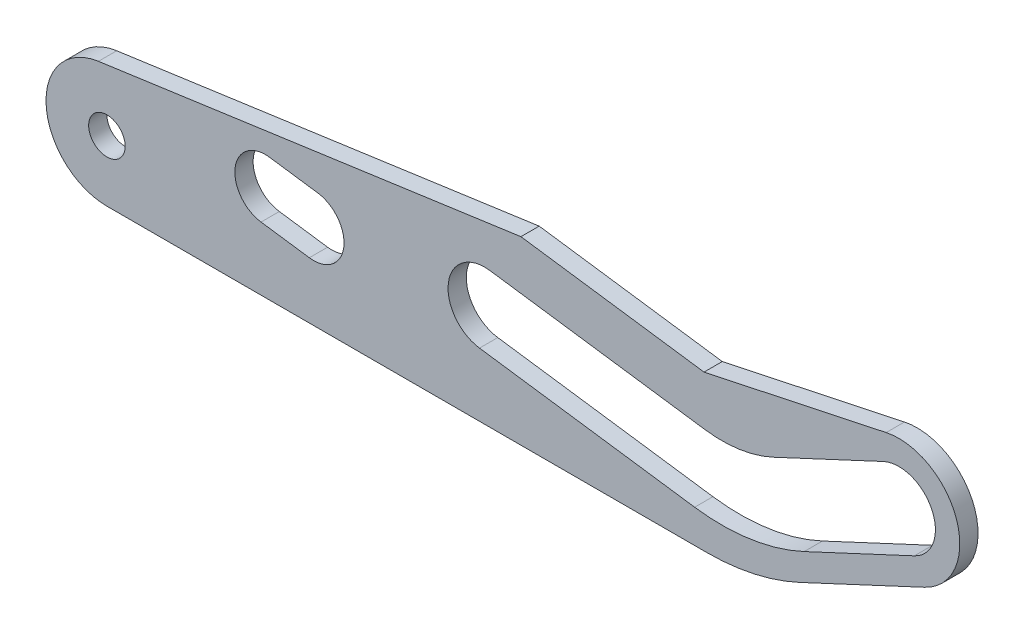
ISO-10303-21;
HEADER;
FILE_DESCRIPTION(('STEP AP214'),'2;1');
FILE_NAME('part.step','',(''),(''),'','','');
FILE_SCHEMA(('AUTOMOTIVE_DESIGN { 1 0 10303 214 1 1 1 1 }'));
ENDSEC;
DATA;
#1=APPLICATION_CONTEXT('core data for automotive mechanical design processes');
#2=APPLICATION_PROTOCOL_DEFINITION('international standard','automotive_design',2000,#1);
#3=PRODUCT_CONTEXT('',#1,'mechanical');
#4=PRODUCT('Part','Part','',(#3));
#5=PRODUCT_RELATED_PRODUCT_CATEGORY('part','',(#4));
#6=PRODUCT_DEFINITION_FORMATION('','',#4);
#7=PRODUCT_DEFINITION_CONTEXT('part definition',#1,'design');
#8=PRODUCT_DEFINITION('design','',#6,#7);
#9=PRODUCT_DEFINITION_SHAPE('','',#8);
#10=(LENGTH_UNIT() NAMED_UNIT(*) SI_UNIT(.MILLI.,.METRE.));
#11=(NAMED_UNIT(*) PLANE_ANGLE_UNIT() SI_UNIT($,.RADIAN.));
#12=(NAMED_UNIT(*) SI_UNIT($,.STERADIAN.) SOLID_ANGLE_UNIT());
#13=UNCERTAINTY_MEASURE_WITH_UNIT(LENGTH_MEASURE(1.E-05),#10,'distance_accuracy_value','');
#14=(GEOMETRIC_REPRESENTATION_CONTEXT(3) GLOBAL_UNCERTAINTY_ASSIGNED_CONTEXT((#13)) GLOBAL_UNIT_ASSIGNED_CONTEXT((#10,
#11,#12)) REPRESENTATION_CONTEXT('',''));
#15=CARTESIAN_POINT('',(0.,0.,0.));
#16=DIRECTION('',(0.,0.,1.));
#17=DIRECTION('',(1.,0.,0.));
#18=AXIS2_PLACEMENT_3D('',#15,#16,#17);
#19=CARTESIAN_POINT('',(0.,0.,0.75));
#20=DIRECTION('',(0.,0.,1.));
#21=DIRECTION('',(1.,0.,0.));
#22=AXIS2_PLACEMENT_3D('',#19,#20,#21);
#23=PLANE('',#22);
#24=CARTESIAN_POINT('',(0.,0.,0.75));
#25=DIRECTION('',(0.,0.,1.));
#26=DIRECTION('',(1.,0.,0.));
#27=AXIS2_PLACEMENT_3D('',#24,#25,#26);
#28=CIRCLE('',#27,1.5);
#29=CARTESIAN_POINT('',(1.5,0.,0.75));
#30=VERTEX_POINT('',#29);
#31=EDGE_CURVE('E175',#30,#30,#28,.T.);
#32=ORIENTED_EDGE('',*,*,#31,.F.);
#33=EDGE_LOOP('',(#32));
#34=FACE_BOUND('',#33,.T.);
#35=CARTESIAN_POINT('',(0.,0.,0.75));
#36=DIRECTION('',(0.,0.,1.));
#37=DIRECTION('',(1.,0.,0.));
#38=AXIS2_PLACEMENT_3D('',#35,#36,#37);
#39=CIRCLE('',#38,5.);
#40=CARTESIAN_POINT('',(-0.695865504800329,4.95134034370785,0.75));
#41=VERTEX_POINT('',#40);
#42=CARTESIAN_POINT('',(0.,-5.,0.75));
#43=VERTEX_POINT('',#42);
#44=EDGE_CURVE('E289',#41,#43,#39,.T.);
#45=ORIENTED_EDGE('',*,*,#44,.T.);
#46=DIRECTION('',(1.,0.,0.));
#47=VECTOR('',#46,1.);
#48=CARTESIAN_POINT('',(0.,-5.,0.75));
#49=LINE('',#48,#47);
#50=CARTESIAN_POINT('',(49.2509278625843,-5.,0.75));
#51=VERTEX_POINT('',#50);
#52=EDGE_CURVE('E292',#43,#51,#49,.T.);
#53=ORIENTED_EDGE('',*,*,#52,.T.);
#54=CARTESIAN_POINT('',(49.2509278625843,13.,0.75));
#55=DIRECTION('',(0.,0.,1.));
#56=DIRECTION('',(1.,0.,0.));
#57=AXIS2_PLACEMENT_3D('',#54,#55,#56);
#58=CIRCLE('',#57,18.);
#59=CARTESIAN_POINT('',(56.8580565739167,-3.31354016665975,0.75));
#60=VERTEX_POINT('',#59);
#61=EDGE_CURVE('E294',#51,#60,#58,.T.);
#62=ORIENTED_EDGE('',*,*,#61,.T.);
#63=DIRECTION('',(0.906307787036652,0.422618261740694,0.));
#64=VECTOR('',#63,1.);
#65=CARTESIAN_POINT('',(67.1130913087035,1.46846106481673,0.75));
#66=LINE('',#65,#64);
#67=CARTESIAN_POINT('',(67.1130913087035,1.46846106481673,0.75));
#68=VERTEX_POINT('',#67);
#69=EDGE_CURVE('E296',#60,#68,#66,.T.);
#70=ORIENTED_EDGE('',*,*,#69,.T.);
#71=CARTESIAN_POINT('',(65.,6.,0.75));
#72=DIRECTION('',(0.,0.,1.));
#73=DIRECTION('',(1.,0.,0.));
#74=AXIS2_PLACEMENT_3D('',#71,#72,#73);
#75=CIRCLE('',#74,5.);
#76=CARTESIAN_POINT('',(63.9604415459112,10.890738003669,0.75));
#77=VERTEX_POINT('',#76);
#78=EDGE_CURVE('E298',#68,#77,#75,.T.);
#79=ORIENTED_EDGE('',*,*,#78,.T.);
#80=DIRECTION('',(-0.978147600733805,-0.207911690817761,0.));
#81=VECTOR('',#80,1.);
#82=CARTESIAN_POINT('',(49.0091398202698,7.71274071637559,0.75));
#83=LINE('',#82,#81);
#84=CARTESIAN_POINT('',(49.0091398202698,7.71274071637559,0.75));
#85=VERTEX_POINT('',#84);
#86=EDGE_CURVE('E300',#77,#85,#83,.T.);
#87=ORIENTED_EDGE('',*,*,#86,.T.);
#88=DIRECTION('',(-0.99026806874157,0.139173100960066,0.));
#89=VECTOR('',#88,1.);
#90=CARTESIAN_POINT('',(33.980829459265,9.82483199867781,0.75));
#91=LINE('',#90,#89);
#92=CARTESIAN_POINT('',(33.980829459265,9.82483199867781,0.75));
#93=VERTEX_POINT('',#92);
#94=EDGE_CURVE('E302',#85,#93,#91,.T.);
#95=ORIENTED_EDGE('',*,*,#94,.T.);
#96=DIRECTION('',(-0.99026806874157,-0.139173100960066,0.));
#97=VECTOR('',#96,1.);
#98=CARTESIAN_POINT('',(-0.695865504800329,4.95134034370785,0.75));
#99=LINE('',#98,#97);
#100=EDGE_CURVE('E304',#93,#41,#99,.T.);
#101=ORIENTED_EDGE('',*,*,#100,.T.);
#102=EDGE_LOOP('',(#45,#53,#62,#70,#79,#87,#95,#101));
#103=FACE_BOUND('',#102,.T.);
#104=DIRECTION('',(0.906307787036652,0.422618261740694,0.));
#105=VECTOR('',#104,1.);
#106=CARTESIAN_POINT('',(66.2678547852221,3.28107663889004,0.75));
#107=LINE('',#106,#105);
#108=CARTESIAN_POINT('',(57.2284860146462,-0.934050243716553,0.75));
#109=VERTEX_POINT('',#108);
#110=CARTESIAN_POINT('',(66.2678547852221,3.28107663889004,0.75));
#111=VERTEX_POINT('',#110);
#112=EDGE_CURVE('E260',#109,#111,#107,.T.);
#113=ORIENTED_EDGE('',*,*,#112,.F.);
#114=CARTESIAN_POINT('',(50.4665938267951,13.5668743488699,0.75));
#115=DIRECTION('',(0.,0.,1.));
#116=DIRECTION('',(1.,0.,0.));
#117=AXIS2_PLACEMENT_3D('',#114,#115,#116);
#118=CIRCLE('',#117,16.);
#119=CARTESIAN_POINT('',(48.2398242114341,-2.27741475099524,0.75));
#120=VERTEX_POINT('',#119);
#121=EDGE_CURVE('E258',#120,#109,#118,.T.);
#122=ORIENTED_EDGE('',*,*,#121,.F.);
#123=DIRECTION('',(0.99026806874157,-0.139173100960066,0.));
#124=VECTOR('',#123,1.);
#125=CARTESIAN_POINT('',(30.5824806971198,0.20416304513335,0.75));
#126=LINE('',#125,#124);
#127=CARTESIAN_POINT('',(30.5824806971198,0.20416304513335,0.75));
#128=VERTEX_POINT('',#127);
#129=EDGE_CURVE('E272',#128,#120,#126,.T.);
#130=ORIENTED_EDGE('',*,*,#129,.F.);
#131=CARTESIAN_POINT('',(31.,3.17496725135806,0.75));
#132=DIRECTION('',(0.,0.,1.));
#133=DIRECTION('',(1.,0.,0.));
#134=AXIS2_PLACEMENT_3D('',#131,#132,#133);
#135=CIRCLE('',#134,3.);
#136=CARTESIAN_POINT('',(31.4175193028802,6.14577145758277,0.75));
#137=VERTEX_POINT('',#136);
#138=EDGE_CURVE('E270',#137,#128,#135,.T.);
#139=ORIENTED_EDGE('',*,*,#138,.F.);
#140=DIRECTION('',(-0.99026806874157,0.139173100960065,0.));
#141=VECTOR('',#140,1.);
#142=CARTESIAN_POINT('',(31.4175193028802,6.14577145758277,0.75));
#143=LINE('',#142,#141);
#144=CARTESIAN_POINT('',(49.0748628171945,3.66419366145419,0.75));
#145=VERTEX_POINT('',#144);
#146=EDGE_CURVE('E268',#145,#137,#143,.T.);
#147=ORIENTED_EDGE('',*,*,#146,.F.);
#148=CARTESIAN_POINT('',(50.4665938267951,13.5668743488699,0.75));
#149=DIRECTION('',(0.,0.,-1.));
#150=DIRECTION('',(1.,0.,0.));
#151=AXIS2_PLACEMENT_3D('',#148,#149,#150);
#152=CIRCLE('',#151,10.);
#153=CARTESIAN_POINT('',(54.692776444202,4.50379647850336,0.75));
#154=VERTEX_POINT('',#153);
#155=EDGE_CURVE('E266',#154,#145,#152,.T.);
#156=ORIENTED_EDGE('',*,*,#155,.F.);
#157=DIRECTION('',(-0.906307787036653,-0.422618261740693,0.));
#158=VECTOR('',#157,1.);
#159=CARTESIAN_POINT('',(63.7321452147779,8.71892336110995,0.75));
#160=LINE('',#159,#158);
#161=CARTESIAN_POINT('',(63.7321452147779,8.71892336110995,0.75));
#162=VERTEX_POINT('',#161);
#163=EDGE_CURVE('E264',#162,#154,#160,.T.);
#164=ORIENTED_EDGE('',*,*,#163,.F.);
#165=CARTESIAN_POINT('',(65.,6.,0.75));
#166=DIRECTION('',(0.,0.,1.));
#167=DIRECTION('',(1.,0.,0.));
#168=AXIS2_PLACEMENT_3D('',#165,#166,#167);
#169=CIRCLE('',#168,2.99999999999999);
#170=EDGE_CURVE('E262',#111,#162,#169,.T.);
#171=ORIENTED_EDGE('',*,*,#170,.F.);
#172=EDGE_LOOP('',(#113,#122,#130,#139,#147,#156,#164,#171));
#173=FACE_BOUND('',#172,.T.);
#174=DIRECTION('',(-0.99026806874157,0.139173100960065,0.));
#175=VECTOR('',#174,1.);
#176=CARTESIAN_POINT('',(17.3090050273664,4.59419732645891,0.75));
#177=LINE('',#176,#175);
#178=CARTESIAN_POINT('',(17.3090050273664,4.59419732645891,0.75));
#179=VERTEX_POINT('',#178);
#180=CARTESIAN_POINT('',(13.3479327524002,5.15088973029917,0.75));
#181=VERTEX_POINT('',#180);
#182=EDGE_CURVE('E246',#179,#181,#177,.T.);
#183=ORIENTED_EDGE('',*,*,#182,.F.);
#184=CARTESIAN_POINT('',(16.9610722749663,2.11852715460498,0.75));
#185=DIRECTION('',(0.,0.,1.));
#186=DIRECTION('',(1.,0.,0.));
#187=AXIS2_PLACEMENT_3D('',#184,#185,#186);
#188=CIRCLE('',#187,2.5);
#189=CARTESIAN_POINT('',(16.6131395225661,-0.357143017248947,0.75));
#190=VERTEX_POINT('',#189);
#191=EDGE_CURVE('E172',#190,#179,#188,.T.);
#192=ORIENTED_EDGE('',*,*,#191,.F.);
#193=DIRECTION('',(0.99026806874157,-0.139173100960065,0.));
#194=VECTOR('',#193,1.);
#195=CARTESIAN_POINT('',(16.6131395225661,-0.357143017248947,0.75));
#196=LINE('',#195,#194);
#197=CARTESIAN_POINT('',(12.6520672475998,0.199549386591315,0.75));
#198=VERTEX_POINT('',#197);
#199=EDGE_CURVE('E250',#198,#190,#196,.T.);
#200=ORIENTED_EDGE('',*,*,#199,.F.);
#201=CARTESIAN_POINT('',(13.,2.67521955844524,0.75));
#202=DIRECTION('',(0.,0.,1.));
#203=DIRECTION('',(1.,0.,0.));
#204=AXIS2_PLACEMENT_3D('',#201,#202,#203);
#205=CIRCLE('',#204,2.5);
#206=EDGE_CURVE('E248',#181,#198,#205,.T.);
#207=ORIENTED_EDGE('',*,*,#206,.F.);
#208=EDGE_LOOP('',(#183,#192,#200,#207));
#209=FACE_BOUND('',#208,.T.);
#210=ADVANCED_FACE('F28',(#34,#103,#173,#209),#23,.T.);
#211=CARTESIAN_POINT('',(0.,0.,0.75));
#212=DIRECTION('',(0.,0.,-1.));
#213=DIRECTION('',(-1.,0.,0.));
#214=AXIS2_PLACEMENT_3D('',#211,#212,#213);
#215=CYLINDRICAL_SURFACE('',#214,5.);
#216=DIRECTION('',(0.,0.,-1.));
#217=VECTOR('',#216,1.);
#218=CARTESIAN_POINT('',(-0.695865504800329,4.95134034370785,0.75));
#219=LINE('',#218,#217);
#220=CARTESIAN_POINT('',(-0.695865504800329,4.95134034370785,-0.75));
#221=VERTEX_POINT('',#220);
#222=EDGE_CURVE('E306',#41,#221,#219,.T.);
#223=ORIENTED_EDGE('',*,*,#222,.T.);
#224=CARTESIAN_POINT('',(0.,0.,-0.75));
#225=DIRECTION('',(0.,0.,1.));
#226=DIRECTION('',(1.,0.,0.));
#227=AXIS2_PLACEMENT_3D('',#224,#225,#226);
#228=CIRCLE('',#227,5.);
#229=CARTESIAN_POINT('',(0.,-5.,-0.75));
#230=VERTEX_POINT('',#229);
#231=EDGE_CURVE('E221',#221,#230,#228,.T.);
#232=ORIENTED_EDGE('',*,*,#231,.T.);
#233=DIRECTION('',(0.,0.,-1.));
#234=VECTOR('',#233,1.);
#235=CARTESIAN_POINT('',(0.,-5.,0.75));
#236=LINE('',#235,#234);
#237=EDGE_CURVE('E11',#43,#230,#236,.T.);
#238=ORIENTED_EDGE('',*,*,#237,.F.);
#239=ORIENTED_EDGE('',*,*,#44,.F.);
#240=EDGE_LOOP('',(#223,#232,#238,#239));
#241=FACE_BOUND('',#240,.T.);
#242=ADVANCED_FACE('F30',(#241),#215,.T.);
#243=CARTESIAN_POINT('',(0.,-5.,0.75));
#244=DIRECTION('',(0.,1.,0.));
#245=DIRECTION('',(-1.,0.,0.));
#246=AXIS2_PLACEMENT_3D('',#243,#244,#245);
#247=PLANE('',#246);
#248=ORIENTED_EDGE('',*,*,#237,.T.);
#249=DIRECTION('',(1.,0.,0.));
#250=VECTOR('',#249,1.);
#251=CARTESIAN_POINT('',(0.,-5.,-0.75));
#252=LINE('',#251,#250);
#253=CARTESIAN_POINT('',(49.2509278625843,-5.,-0.75));
#254=VERTEX_POINT('',#253);
#255=EDGE_CURVE('E224',#230,#254,#252,.T.);
#256=ORIENTED_EDGE('',*,*,#255,.T.);
#257=DIRECTION('',(0.,0.,-1.));
#258=VECTOR('',#257,1.);
#259=CARTESIAN_POINT('',(49.2509278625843,-5.,0.75));
#260=LINE('',#259,#258);
#261=EDGE_CURVE('E36',#51,#254,#260,.T.);
#262=ORIENTED_EDGE('',*,*,#261,.F.);
#263=ORIENTED_EDGE('',*,*,#52,.F.);
#264=EDGE_LOOP('',(#248,#256,#262,#263));
#265=FACE_BOUND('',#264,.T.);
#266=ADVANCED_FACE('F329',(#265),#247,.F.);
#267=CARTESIAN_POINT('',(49.2509278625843,13.,0.75));
#268=DIRECTION('',(0.,0.,-1.));
#269=DIRECTION('',(-1.,0.,0.));
#270=AXIS2_PLACEMENT_3D('',#267,#268,#269);
#271=CYLINDRICAL_SURFACE('',#270,18.);
#272=ORIENTED_EDGE('',*,*,#261,.T.);
#273=CARTESIAN_POINT('',(49.2509278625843,13.,-0.75));
#274=DIRECTION('',(0.,0.,1.));
#275=DIRECTION('',(1.,0.,0.));
#276=AXIS2_PLACEMENT_3D('',#273,#274,#275);
#277=CIRCLE('',#276,18.);
#278=CARTESIAN_POINT('',(56.8580565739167,-3.31354016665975,-0.75));
#279=VERTEX_POINT('',#278);
#280=EDGE_CURVE('E227',#254,#279,#277,.T.);
#281=ORIENTED_EDGE('',*,*,#280,.T.);
#282=DIRECTION('',(0.,0.,-1.));
#283=VECTOR('',#282,1.);
#284=CARTESIAN_POINT('',(56.8580565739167,-3.31354016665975,0.75));
#285=LINE('',#284,#283);
#286=EDGE_CURVE('E316',#60,#279,#285,.T.);
#287=ORIENTED_EDGE('',*,*,#286,.F.);
#288=ORIENTED_EDGE('',*,*,#61,.F.);
#289=EDGE_LOOP('',(#272,#281,#287,#288));
#290=FACE_BOUND('',#289,.T.);
#291=ADVANCED_FACE('F321',(#290),#271,.T.);
#292=CARTESIAN_POINT('',(67.1130913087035,1.46846106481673,0.75));
#293=DIRECTION('',(-0.422618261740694,0.906307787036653,0.));
#294=DIRECTION('',(-0.906307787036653,-0.422618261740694,0.));
#295=AXIS2_PLACEMENT_3D('',#292,#293,#294);
#296=PLANE('',#295);
#297=ORIENTED_EDGE('',*,*,#286,.T.);
#298=DIRECTION('',(0.906307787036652,0.422618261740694,0.));
#299=VECTOR('',#298,1.);
#300=CARTESIAN_POINT('',(67.1130913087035,1.46846106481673,-0.75));
#301=LINE('',#300,#299);
#302=CARTESIAN_POINT('',(67.1130913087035,1.46846106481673,-0.75));
#303=VERTEX_POINT('',#302);
#304=EDGE_CURVE('E230',#279,#303,#301,.T.);
#305=ORIENTED_EDGE('',*,*,#304,.T.);
#306=DIRECTION('',(0.,0.,-1.));
#307=VECTOR('',#306,1.);
#308=CARTESIAN_POINT('',(67.1130913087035,1.46846106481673,0.75));
#309=LINE('',#308,#307);
#310=EDGE_CURVE('E314',#68,#303,#309,.T.);
#311=ORIENTED_EDGE('',*,*,#310,.F.);
#312=ORIENTED_EDGE('',*,*,#69,.F.);
#313=EDGE_LOOP('',(#297,#305,#311,#312));
#314=FACE_BOUND('',#313,.T.);
#315=ADVANCED_FACE('F354',(#314),#296,.F.);
#316=CARTESIAN_POINT('',(65.,6.,0.75));
#317=DIRECTION('',(0.,0.,-1.));
#318=DIRECTION('',(-1.,0.,0.));
#319=AXIS2_PLACEMENT_3D('',#316,#317,#318);
#320=CYLINDRICAL_SURFACE('',#319,5.);
#321=ORIENTED_EDGE('',*,*,#310,.T.);
#322=CARTESIAN_POINT('',(65.,6.,-0.75));
#323=DIRECTION('',(0.,0.,1.));
#324=DIRECTION('',(1.,0.,0.));
#325=AXIS2_PLACEMENT_3D('',#322,#323,#324);
#326=CIRCLE('',#325,5.);
#327=CARTESIAN_POINT('',(63.9604415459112,10.890738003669,-0.75));
#328=VERTEX_POINT('',#327);
#329=EDGE_CURVE('E233',#303,#328,#326,.T.);
#330=ORIENTED_EDGE('',*,*,#329,.T.);
#331=DIRECTION('',(0.,0.,-1.));
#332=VECTOR('',#331,1.);
#333=CARTESIAN_POINT('',(63.9604415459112,10.890738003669,0.75));
#334=LINE('',#333,#332);
#335=EDGE_CURVE('E312',#77,#328,#334,.T.);
#336=ORIENTED_EDGE('',*,*,#335,.F.);
#337=ORIENTED_EDGE('',*,*,#78,.F.);
#338=EDGE_LOOP('',(#321,#330,#336,#337));
#339=FACE_BOUND('',#338,.T.);
#340=ADVANCED_FACE('F351',(#339),#320,.T.);
#341=CARTESIAN_POINT('',(49.0091398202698,7.71274071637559,0.75));
#342=DIRECTION('',(0.207911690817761,-0.978147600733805,0.));
#343=DIRECTION('',(0.978147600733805,0.207911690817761,0.));
#344=AXIS2_PLACEMENT_3D('',#341,#342,#343);
#345=PLANE('',#344);
#346=ORIENTED_EDGE('',*,*,#335,.T.);
#347=DIRECTION('',(-0.978147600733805,-0.207911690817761,0.));
#348=VECTOR('',#347,1.);
#349=CARTESIAN_POINT('',(49.0091398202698,7.71274071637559,-0.75));
#350=LINE('',#349,#348);
#351=CARTESIAN_POINT('',(49.0091398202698,7.71274071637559,-0.75));
#352=VERTEX_POINT('',#351);
#353=EDGE_CURVE('E236',#328,#352,#350,.T.);
#354=ORIENTED_EDGE('',*,*,#353,.T.);
#355=DIRECTION('',(0.,0.,-1.));
#356=VECTOR('',#355,1.);
#357=CARTESIAN_POINT('',(49.0091398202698,7.71274071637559,0.75));
#358=LINE('',#357,#356);
#359=EDGE_CURVE('E310',#85,#352,#358,.T.);
#360=ORIENTED_EDGE('',*,*,#359,.F.);
#361=ORIENTED_EDGE('',*,*,#86,.F.);
#362=EDGE_LOOP('',(#346,#354,#360,#361));
#363=FACE_BOUND('',#362,.T.);
#364=ADVANCED_FACE('F346',(#363),#345,.F.);
#365=CARTESIAN_POINT('',(33.980829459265,9.82483199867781,0.75));
#366=DIRECTION('',(-0.139173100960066,-0.99026806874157,0.));
#367=DIRECTION('',(0.99026806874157,-0.139173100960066,0.));
#368=AXIS2_PLACEMENT_3D('',#365,#366,#367);
#369=PLANE('',#368);
#370=ORIENTED_EDGE('',*,*,#359,.T.);
#371=DIRECTION('',(-0.99026806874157,0.139173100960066,0.));
#372=VECTOR('',#371,1.);
#373=CARTESIAN_POINT('',(33.980829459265,9.82483199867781,-0.75));
#374=LINE('',#373,#372);
#375=CARTESIAN_POINT('',(33.980829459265,9.82483199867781,-0.75));
#376=VERTEX_POINT('',#375);
#377=EDGE_CURVE('E239',#352,#376,#374,.T.);
#378=ORIENTED_EDGE('',*,*,#377,.T.);
#379=DIRECTION('',(0.,0.,-1.));
#380=VECTOR('',#379,1.);
#381=CARTESIAN_POINT('',(33.980829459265,9.82483199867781,0.75));
#382=LINE('',#381,#380);
#383=EDGE_CURVE('E308',#93,#376,#382,.T.);
#384=ORIENTED_EDGE('',*,*,#383,.F.);
#385=ORIENTED_EDGE('',*,*,#94,.F.);
#386=EDGE_LOOP('',(#370,#378,#384,#385));
#387=FACE_BOUND('',#386,.T.);
#388=ADVANCED_FACE('F342',(#387),#369,.F.);
#389=CARTESIAN_POINT('',(-0.695865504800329,4.95134034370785,0.75));
#390=DIRECTION('',(0.139173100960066,-0.99026806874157,0.));
#391=DIRECTION('',(0.99026806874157,0.139173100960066,0.));
#392=AXIS2_PLACEMENT_3D('',#389,#390,#391);
#393=PLANE('',#392);
#394=ORIENTED_EDGE('',*,*,#383,.T.);
#395=DIRECTION('',(-0.99026806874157,-0.139173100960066,0.));
#396=VECTOR('',#395,1.);
#397=CARTESIAN_POINT('',(-0.695865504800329,4.95134034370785,-0.75));
#398=LINE('',#397,#396);
#399=EDGE_CURVE('E242',#376,#221,#398,.T.);
#400=ORIENTED_EDGE('',*,*,#399,.T.);
#401=ORIENTED_EDGE('',*,*,#222,.F.);
#402=ORIENTED_EDGE('',*,*,#100,.F.);
#403=EDGE_LOOP('',(#394,#400,#401,#402));
#404=FACE_BOUND('',#403,.T.);
#405=ADVANCED_FACE('F337',(#404),#393,.F.);
#406=CARTESIAN_POINT('',(50.4665938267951,13.5668743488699,0.75));
#407=DIRECTION('',(0.,0.,-1.));
#408=DIRECTION('',(-1.,0.,0.));
#409=AXIS2_PLACEMENT_3D('',#406,#407,#408);
#410=CYLINDRICAL_SURFACE('',#409,16.);
#411=DIRECTION('',(0.,0.,-1.));
#412=VECTOR('',#411,1.);
#413=CARTESIAN_POINT('',(57.2284860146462,-0.934050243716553,0.75));
#414=LINE('',#413,#412);
#415=CARTESIAN_POINT('',(57.2284860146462,-0.934050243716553,-0.75));
#416=VERTEX_POINT('',#415);
#417=EDGE_CURVE('E287',#109,#416,#414,.T.);
#418=ORIENTED_EDGE('',*,*,#417,.T.);
#419=CARTESIAN_POINT('',(50.4665938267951,13.5668743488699,-0.75));
#420=DIRECTION('',(0.,0.,1.));
#421=DIRECTION('',(1.,0.,0.));
#422=AXIS2_PLACEMENT_3D('',#419,#420,#421);
#423=CIRCLE('',#422,16.);
#424=CARTESIAN_POINT('',(48.2398242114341,-2.27741475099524,-0.75));
#425=VERTEX_POINT('',#424);
#426=EDGE_CURVE('E197',#425,#416,#423,.T.);
#427=ORIENTED_EDGE('',*,*,#426,.F.);
#428=DIRECTION('',(0.,0.,-1.));
#429=VECTOR('',#428,1.);
#430=CARTESIAN_POINT('',(48.2398242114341,-2.27741475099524,0.75));
#431=LINE('',#430,#429);
#432=EDGE_CURVE('E274',#120,#425,#431,.T.);
#433=ORIENTED_EDGE('',*,*,#432,.F.);
#434=ORIENTED_EDGE('',*,*,#121,.T.);
#435=EDGE_LOOP('',(#418,#427,#433,#434));
#436=FACE_BOUND('',#435,.T.);
#437=ADVANCED_FACE('F413',(#436),#410,.F.);
#438=CARTESIAN_POINT('',(66.2678547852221,3.28107663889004,0.75));
#439=DIRECTION('',(-0.422618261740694,0.906307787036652,0.));
#440=DIRECTION('',(-0.906307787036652,-0.422618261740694,0.));
#441=AXIS2_PLACEMENT_3D('',#438,#439,#440);
#442=PLANE('',#441);
#443=DIRECTION('',(0.,0.,-1.));
#444=VECTOR('',#443,1.);
#445=CARTESIAN_POINT('',(66.2678547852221,3.28107663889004,0.75));
#446=LINE('',#445,#444);
#447=CARTESIAN_POINT('',(66.2678547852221,3.28107663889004,-0.75));
#448=VERTEX_POINT('',#447);
#449=EDGE_CURVE('E285',#111,#448,#446,.T.);
#450=ORIENTED_EDGE('',*,*,#449,.T.);
#451=DIRECTION('',(0.906307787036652,0.422618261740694,0.));
#452=VECTOR('',#451,1.);
#453=CARTESIAN_POINT('',(66.2678547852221,3.28107663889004,-0.75));
#454=LINE('',#453,#452);
#455=EDGE_CURVE('E200',#416,#448,#454,.T.);
#456=ORIENTED_EDGE('',*,*,#455,.F.);
#457=ORIENTED_EDGE('',*,*,#417,.F.);
#458=ORIENTED_EDGE('',*,*,#112,.T.);
#459=EDGE_LOOP('',(#450,#456,#457,#458));
#460=FACE_BOUND('',#459,.T.);
#461=ADVANCED_FACE('F409',(#460),#442,.T.);
#462=CARTESIAN_POINT('',(65.,6.,0.75));
#463=DIRECTION('',(0.,0.,-1.));
#464=DIRECTION('',(-1.,0.,0.));
#465=AXIS2_PLACEMENT_3D('',#462,#463,#464);
#466=CYLINDRICAL_SURFACE('',#465,2.99999999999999);
#467=DIRECTION('',(0.,0.,-1.));
#468=VECTOR('',#467,1.);
#469=CARTESIAN_POINT('',(63.7321452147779,8.71892336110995,0.75));
#470=LINE('',#469,#468);
#471=CARTESIAN_POINT('',(63.7321452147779,8.71892336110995,-0.75));
#472=VERTEX_POINT('',#471);
#473=EDGE_CURVE('E283',#162,#472,#470,.T.);
#474=ORIENTED_EDGE('',*,*,#473,.T.);
#475=CARTESIAN_POINT('',(65.,6.,-0.75));
#476=DIRECTION('',(0.,0.,1.));
#477=DIRECTION('',(1.,0.,0.));
#478=AXIS2_PLACEMENT_3D('',#475,#476,#477);
#479=CIRCLE('',#478,2.99999999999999);
#480=EDGE_CURVE('E203',#448,#472,#479,.T.);
#481=ORIENTED_EDGE('',*,*,#480,.F.);
#482=ORIENTED_EDGE('',*,*,#449,.F.);
#483=ORIENTED_EDGE('',*,*,#170,.T.);
#484=EDGE_LOOP('',(#474,#481,#482,#483));
#485=FACE_BOUND('',#484,.T.);
#486=ADVANCED_FACE('F405',(#485),#466,.F.);
#487=CARTESIAN_POINT('',(63.7321452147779,8.71892336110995,0.75));
#488=DIRECTION('',(0.422618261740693,-0.906307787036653,0.));
#489=DIRECTION('',(0.906307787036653,0.422618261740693,0.));
#490=AXIS2_PLACEMENT_3D('',#487,#488,#489);
#491=PLANE('',#490);
#492=DIRECTION('',(0.,0.,-1.));
#493=VECTOR('',#492,1.);
#494=CARTESIAN_POINT('',(54.692776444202,4.50379647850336,0.75));
#495=LINE('',#494,#493);
#496=CARTESIAN_POINT('',(54.692776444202,4.50379647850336,-0.75));
#497=VERTEX_POINT('',#496);
#498=EDGE_CURVE('E281',#154,#497,#495,.T.);
#499=ORIENTED_EDGE('',*,*,#498,.T.);
#500=DIRECTION('',(-0.906307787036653,-0.422618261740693,0.));
#501=VECTOR('',#500,1.);
#502=CARTESIAN_POINT('',(63.7321452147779,8.71892336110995,-0.75));
#503=LINE('',#502,#501);
#504=EDGE_CURVE('E206',#472,#497,#503,.T.);
#505=ORIENTED_EDGE('',*,*,#504,.F.);
#506=ORIENTED_EDGE('',*,*,#473,.F.);
#507=ORIENTED_EDGE('',*,*,#163,.T.);
#508=EDGE_LOOP('',(#499,#505,#506,#507));
#509=FACE_BOUND('',#508,.T.);
#510=ADVANCED_FACE('F401',(#509),#491,.T.);
#511=CARTESIAN_POINT('',(50.4665938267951,13.5668743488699,0.75));
#512=DIRECTION('',(0.,0.,-1.));
#513=DIRECTION('',(-1.,0.,0.));
#514=AXIS2_PLACEMENT_3D('',#511,#512,#513);
#515=CYLINDRICAL_SURFACE('',#514,10.);
#516=DIRECTION('',(0.,0.,-1.));
#517=VECTOR('',#516,1.);
#518=CARTESIAN_POINT('',(49.0748628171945,3.66419366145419,0.75));
#519=LINE('',#518,#517);
#520=CARTESIAN_POINT('',(49.0748628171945,3.66419366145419,-0.75));
#521=VERTEX_POINT('',#520);
#522=EDGE_CURVE('E279',#145,#521,#519,.T.);
#523=ORIENTED_EDGE('',*,*,#522,.T.);
#524=CARTESIAN_POINT('',(50.4665938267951,13.5668743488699,-0.75));
#525=DIRECTION('',(0.,0.,-1.));
#526=DIRECTION('',(1.,0.,0.));
#527=AXIS2_PLACEMENT_3D('',#524,#525,#526);
#528=CIRCLE('',#527,10.);
#529=EDGE_CURVE('E209',#497,#521,#528,.T.);
#530=ORIENTED_EDGE('',*,*,#529,.F.);
#531=ORIENTED_EDGE('',*,*,#498,.F.);
#532=ORIENTED_EDGE('',*,*,#155,.T.);
#533=EDGE_LOOP('',(#523,#530,#531,#532));
#534=FACE_BOUND('',#533,.T.);
#535=ADVANCED_FACE('F397',(#534),#515,.T.);
#536=CARTESIAN_POINT('',(31.4175193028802,6.14577145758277,0.75));
#537=DIRECTION('',(-0.139173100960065,-0.99026806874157,0.));
#538=DIRECTION('',(0.99026806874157,-0.139173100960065,0.));
#539=AXIS2_PLACEMENT_3D('',#536,#537,#538);
#540=PLANE('',#539);
#541=DIRECTION('',(0.,0.,-1.));
#542=VECTOR('',#541,1.);
#543=CARTESIAN_POINT('',(31.4175193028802,6.14577145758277,0.75));
#544=LINE('',#543,#542);
#545=CARTESIAN_POINT('',(31.4175193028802,6.14577145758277,-0.75));
#546=VERTEX_POINT('',#545);
#547=EDGE_CURVE('E277',#137,#546,#544,.T.);
#548=ORIENTED_EDGE('',*,*,#547,.T.);
#549=DIRECTION('',(-0.99026806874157,0.139173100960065,0.));
#550=VECTOR('',#549,1.);
#551=CARTESIAN_POINT('',(31.4175193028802,6.14577145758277,-0.75));
#552=LINE('',#551,#550);
#553=EDGE_CURVE('E212',#521,#546,#552,.T.);
#554=ORIENTED_EDGE('',*,*,#553,.F.);
#555=ORIENTED_EDGE('',*,*,#522,.F.);
#556=ORIENTED_EDGE('',*,*,#146,.T.);
#557=EDGE_LOOP('',(#548,#554,#555,#556));
#558=FACE_BOUND('',#557,.T.);
#559=ADVANCED_FACE('F393',(#558),#540,.T.);
#560=CARTESIAN_POINT('',(31.,3.17496725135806,0.75));
#561=DIRECTION('',(0.,0.,-1.));
#562=DIRECTION('',(-1.,0.,0.));
#563=AXIS2_PLACEMENT_3D('',#560,#561,#562);
#564=CYLINDRICAL_SURFACE('',#563,3.);
#565=DIRECTION('',(0.,0.,-1.));
#566=VECTOR('',#565,1.);
#567=CARTESIAN_POINT('',(30.5824806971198,0.20416304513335,0.75));
#568=LINE('',#567,#566);
#569=CARTESIAN_POINT('',(30.5824806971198,0.20416304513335,-0.75));
#570=VERTEX_POINT('',#569);
#571=EDGE_CURVE('E51',#128,#570,#568,.T.);
#572=ORIENTED_EDGE('',*,*,#571,.T.);
#573=CARTESIAN_POINT('',(31.,3.17496725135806,-0.75));
#574=DIRECTION('',(0.,0.,1.));
#575=DIRECTION('',(1.,0.,0.));
#576=AXIS2_PLACEMENT_3D('',#573,#574,#575);
#577=CIRCLE('',#576,3.);
#578=EDGE_CURVE('E215',#546,#570,#577,.T.);
#579=ORIENTED_EDGE('',*,*,#578,.F.);
#580=ORIENTED_EDGE('',*,*,#547,.F.);
#581=ORIENTED_EDGE('',*,*,#138,.T.);
#582=EDGE_LOOP('',(#572,#579,#580,#581));
#583=FACE_BOUND('',#582,.T.);
#584=ADVANCED_FACE('F390',(#583),#564,.F.);
#585=CARTESIAN_POINT('',(30.5824806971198,0.20416304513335,0.75));
#586=DIRECTION('',(0.139173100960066,0.99026806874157,0.));
#587=DIRECTION('',(-0.99026806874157,0.139173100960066,0.));
#588=AXIS2_PLACEMENT_3D('',#585,#586,#587);
#589=PLANE('',#588);
#590=ORIENTED_EDGE('',*,*,#432,.T.);
#591=DIRECTION('',(0.99026806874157,-0.139173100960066,0.));
#592=VECTOR('',#591,1.);
#593=CARTESIAN_POINT('',(30.5824806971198,0.20416304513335,-0.75));
#594=LINE('',#593,#592);
#595=EDGE_CURVE('E218',#570,#425,#594,.T.);
#596=ORIENTED_EDGE('',*,*,#595,.F.);
#597=ORIENTED_EDGE('',*,*,#571,.F.);
#598=ORIENTED_EDGE('',*,*,#129,.T.);
#599=EDGE_LOOP('',(#590,#596,#597,#598));
#600=FACE_BOUND('',#599,.T.);
#601=ADVANCED_FACE('F386',(#600),#589,.T.);
#602=CARTESIAN_POINT('',(0.,0.,0.75));
#603=DIRECTION('',(0.,0.,-1.));
#604=DIRECTION('',(-1.,0.,0.));
#605=AXIS2_PLACEMENT_3D('',#602,#603,#604);
#606=CYLINDRICAL_SURFACE('',#605,1.5);
#607=ORIENTED_EDGE('',*,*,#31,.T.);
#608=EDGE_LOOP('',(#607));
#609=FACE_BOUND('',#608,.T.);
#610=CARTESIAN_POINT('',(0.,0.,-0.75));
#611=DIRECTION('',(0.,0.,1.));
#612=DIRECTION('',(1.,0.,0.));
#613=AXIS2_PLACEMENT_3D('',#610,#611,#612);
#614=CIRCLE('',#613,1.5);
#615=CARTESIAN_POINT('',(1.5,0.,-0.75));
#616=VERTEX_POINT('',#615);
#617=EDGE_CURVE('E194',#616,#616,#614,.T.);
#618=ORIENTED_EDGE('',*,*,#617,.F.);
#619=EDGE_LOOP('',(#618));
#620=FACE_BOUND('',#619,.T.);
#621=ADVANCED_FACE('F383',(#609,#620),#606,.F.);
#622=CARTESIAN_POINT('',(16.9610722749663,2.11852715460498,0.75));
#623=DIRECTION('',(0.,0.,-1.));
#624=DIRECTION('',(-1.,0.,0.));
#625=AXIS2_PLACEMENT_3D('',#622,#623,#624);
#626=CYLINDRICAL_SURFACE('',#625,2.5);
#627=DIRECTION('',(0.,0.,-1.));
#628=VECTOR('',#627,1.);
#629=CARTESIAN_POINT('',(17.3090050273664,4.59419732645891,0.75));
#630=LINE('',#629,#628);
#631=CARTESIAN_POINT('',(17.3090050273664,4.59419732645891,-0.75));
#632=VERTEX_POINT('',#631);
#633=EDGE_CURVE('E164',#179,#632,#630,.T.);
#634=ORIENTED_EDGE('',*,*,#633,.T.);
#635=CARTESIAN_POINT('',(16.9610722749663,2.11852715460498,-0.75));
#636=DIRECTION('',(0.,0.,1.));
#637=DIRECTION('',(1.,0.,0.));
#638=AXIS2_PLACEMENT_3D('',#635,#636,#637);
#639=CIRCLE('',#638,2.5);
#640=CARTESIAN_POINT('',(16.6131395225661,-0.357143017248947,-0.75));
#641=VERTEX_POINT('',#640);
#642=EDGE_CURVE('E169',#641,#632,#639,.T.);
#643=ORIENTED_EDGE('',*,*,#642,.F.);
#644=DIRECTION('',(0.,0.,-1.));
#645=VECTOR('',#644,1.);
#646=CARTESIAN_POINT('',(16.6131395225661,-0.357143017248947,0.75));
#647=LINE('',#646,#645);
#648=EDGE_CURVE('E252',#190,#641,#647,.T.);
#649=ORIENTED_EDGE('',*,*,#648,.F.);
#650=ORIENTED_EDGE('',*,*,#191,.T.);
#651=EDGE_LOOP('',(#634,#643,#649,#650));
#652=FACE_BOUND('',#651,.T.);
#653=ADVANCED_FACE('F166',(#652),#626,.F.);
#654=CARTESIAN_POINT('',(17.3090050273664,4.59419732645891,0.75));
#655=DIRECTION('',(-0.139173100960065,-0.99026806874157,0.));
#656=DIRECTION('',(0.99026806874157,-0.139173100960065,0.));
#657=AXIS2_PLACEMENT_3D('',#654,#655,#656);
#658=PLANE('',#657);
#659=DIRECTION('',(0.,0.,-1.));
#660=VECTOR('',#659,1.);
#661=CARTESIAN_POINT('',(13.3479327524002,5.15088973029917,0.75));
#662=LINE('',#661,#660);
#663=CARTESIAN_POINT('',(13.3479327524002,5.15088973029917,-0.75));
#664=VERTEX_POINT('',#663);
#665=EDGE_CURVE('E176',#181,#664,#662,.T.);
#666=ORIENTED_EDGE('',*,*,#665,.T.);
#667=DIRECTION('',(-0.99026806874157,0.139173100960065,0.));
#668=VECTOR('',#667,1.);
#669=CARTESIAN_POINT('',(17.3090050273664,4.59419732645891,-0.75));
#670=LINE('',#669,#668);
#671=EDGE_CURVE('E179',#632,#664,#670,.T.);
#672=ORIENTED_EDGE('',*,*,#671,.F.);
#673=ORIENTED_EDGE('',*,*,#633,.F.);
#674=ORIENTED_EDGE('',*,*,#182,.T.);
#675=EDGE_LOOP('',(#666,#672,#673,#674));
#676=FACE_BOUND('',#675,.T.);
#677=ADVANCED_FACE('F180',(#676),#658,.T.);
#678=CARTESIAN_POINT('',(13.,2.67521955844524,0.75));
#679=DIRECTION('',(0.,0.,-1.));
#680=DIRECTION('',(-1.,0.,0.));
#681=AXIS2_PLACEMENT_3D('',#678,#679,#680);
#682=CYLINDRICAL_SURFACE('',#681,2.5);
#683=DIRECTION('',(0.,0.,-1.));
#684=VECTOR('',#683,1.);
#685=CARTESIAN_POINT('',(12.6520672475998,0.199549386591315,0.75));
#686=LINE('',#685,#684);
#687=CARTESIAN_POINT('',(12.6520672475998,0.199549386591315,-0.75));
#688=VERTEX_POINT('',#687);
#689=EDGE_CURVE('E43',#198,#688,#686,.T.);
#690=ORIENTED_EDGE('',*,*,#689,.T.);
#691=CARTESIAN_POINT('',(13.,2.67521955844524,-0.75));
#692=DIRECTION('',(0.,0.,1.));
#693=DIRECTION('',(1.,0.,0.));
#694=AXIS2_PLACEMENT_3D('',#691,#692,#693);
#695=CIRCLE('',#694,2.5);
#696=EDGE_CURVE('E185',#664,#688,#695,.T.);
#697=ORIENTED_EDGE('',*,*,#696,.F.);
#698=ORIENTED_EDGE('',*,*,#665,.F.);
#699=ORIENTED_EDGE('',*,*,#206,.T.);
#700=EDGE_LOOP('',(#690,#697,#698,#699));
#701=FACE_BOUND('',#700,.T.);
#702=ADVANCED_FACE('F368',(#701),#682,.F.);
#703=CARTESIAN_POINT('',(16.6131395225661,-0.357143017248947,0.75));
#704=DIRECTION('',(0.139173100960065,0.99026806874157,0.));
#705=DIRECTION('',(-0.99026806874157,0.139173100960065,0.));
#706=AXIS2_PLACEMENT_3D('',#703,#704,#705);
#707=PLANE('',#706);
#708=ORIENTED_EDGE('',*,*,#648,.T.);
#709=DIRECTION('',(0.99026806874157,-0.139173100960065,0.));
#710=VECTOR('',#709,1.);
#711=CARTESIAN_POINT('',(16.6131395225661,-0.357143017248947,-0.75));
#712=LINE('',#711,#710);
#713=EDGE_CURVE('E189',#688,#641,#712,.T.);
#714=ORIENTED_EDGE('',*,*,#713,.F.);
#715=ORIENTED_EDGE('',*,*,#689,.F.);
#716=ORIENTED_EDGE('',*,*,#199,.T.);
#717=EDGE_LOOP('',(#708,#714,#715,#716));
#718=FACE_BOUND('',#717,.T.);
#719=ADVANCED_FACE('F369',(#718),#707,.T.);
#720=CARTESIAN_POINT('',(0.,0.,-0.75));
#721=DIRECTION('',(0.,0.,1.));
#722=DIRECTION('',(1.,0.,0.));
#723=AXIS2_PLACEMENT_3D('',#720,#721,#722);
#724=PLANE('',#723);
#725=ORIENTED_EDGE('',*,*,#713,.T.);
#726=ORIENTED_EDGE('',*,*,#642,.T.);
#727=ORIENTED_EDGE('',*,*,#671,.T.);
#728=ORIENTED_EDGE('',*,*,#696,.T.);
#729=EDGE_LOOP('',(#725,#726,#727,#728));
#730=FACE_BOUND('',#729,.T.);
#731=ORIENTED_EDGE('',*,*,#617,.T.);
#732=EDGE_LOOP('',(#731));
#733=FACE_BOUND('',#732,.T.);
#734=ORIENTED_EDGE('',*,*,#595,.T.);
#735=ORIENTED_EDGE('',*,*,#426,.T.);
#736=ORIENTED_EDGE('',*,*,#455,.T.);
#737=ORIENTED_EDGE('',*,*,#480,.T.);
#738=ORIENTED_EDGE('',*,*,#504,.T.);
#739=ORIENTED_EDGE('',*,*,#529,.T.);
#740=ORIENTED_EDGE('',*,*,#553,.T.);
#741=ORIENTED_EDGE('',*,*,#578,.T.);
#742=EDGE_LOOP('',(#734,#735,#736,#737,#738,#739,#740,#741));
#743=FACE_BOUND('',#742,.T.);
#744=ORIENTED_EDGE('',*,*,#231,.F.);
#745=ORIENTED_EDGE('',*,*,#399,.F.);
#746=ORIENTED_EDGE('',*,*,#377,.F.);
#747=ORIENTED_EDGE('',*,*,#353,.F.);
#748=ORIENTED_EDGE('',*,*,#329,.F.);
#749=ORIENTED_EDGE('',*,*,#304,.F.);
#750=ORIENTED_EDGE('',*,*,#280,.F.);
#751=ORIENTED_EDGE('',*,*,#255,.F.);
#752=EDGE_LOOP('',(#744,#745,#746,#747,#748,#749,#750,#751));
#753=FACE_BOUND('',#752,.T.);
#754=ADVANCED_FACE('F187',(#730,#733,#743,#753),#724,.F.);
#755=CLOSED_SHELL('',(#210,#242,#266,#291,#315,#340,#364,#388,#405,#437,#461,#486,#510,#535,
#559,#584,#601,#621,#653,#677,#702,#719,#754));
#756=MANIFOLD_SOLID_BREP('B2',#755);
#757=ADVANCED_BREP_SHAPE_REPRESENTATION('',(#18,#756),#14);
#758=SHAPE_DEFINITION_REPRESENTATION(#9,#757);
ENDSEC;
END-ISO-10303-21;
